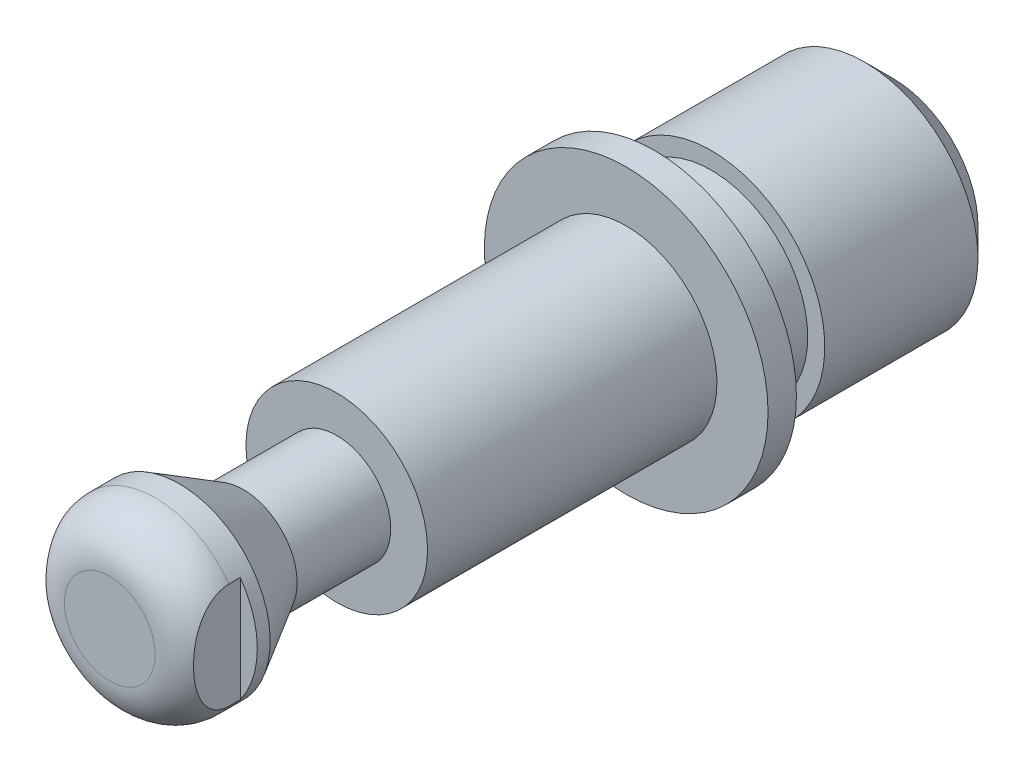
ISO-10303-21;
HEADER;
FILE_DESCRIPTION(('STEP AP214'),'2;1');
FILE_NAME('part.step','',(''),(''),'','','');
FILE_SCHEMA(('AUTOMOTIVE_DESIGN { 1 0 10303 214 1 1 1 1 }'));
ENDSEC;
DATA;
#1=APPLICATION_CONTEXT('core data for automotive mechanical design processes');
#2=APPLICATION_PROTOCOL_DEFINITION('international standard','automotive_design',2000,#1);
#3=PRODUCT_CONTEXT('',#1,'mechanical');
#4=PRODUCT('Part','Part','',(#3));
#5=PRODUCT_RELATED_PRODUCT_CATEGORY('part','',(#4));
#6=PRODUCT_DEFINITION_FORMATION('','',#4);
#7=PRODUCT_DEFINITION_CONTEXT('part definition',#1,'design');
#8=PRODUCT_DEFINITION('design','',#6,#7);
#9=PRODUCT_DEFINITION_SHAPE('','',#8);
#10=(LENGTH_UNIT() NAMED_UNIT(*) SI_UNIT(.MILLI.,.METRE.));
#11=(NAMED_UNIT(*) PLANE_ANGLE_UNIT() SI_UNIT($,.RADIAN.));
#12=(NAMED_UNIT(*) SI_UNIT($,.STERADIAN.) SOLID_ANGLE_UNIT());
#13=UNCERTAINTY_MEASURE_WITH_UNIT(LENGTH_MEASURE(1.E-05),#10,'distance_accuracy_value','');
#14=(GEOMETRIC_REPRESENTATION_CONTEXT(3) GLOBAL_UNCERTAINTY_ASSIGNED_CONTEXT((#13)) GLOBAL_UNIT_ASSIGNED_CONTEXT((#10,
#11,#12)) REPRESENTATION_CONTEXT('',''));
#15=CARTESIAN_POINT('',(0.,0.,0.));
#16=DIRECTION('',(0.,0.,1.));
#17=DIRECTION('',(1.,0.,0.));
#18=AXIS2_PLACEMENT_3D('',#15,#16,#17);
#19=CARTESIAN_POINT('',(0.,0.,0.));
#20=DIRECTION('',(0.,0.,-1.));
#21=DIRECTION('',(0.,1.,0.));
#22=AXIS2_PLACEMENT_3D('',#19,#20,#21);
#23=PLANE('',#22);
#24=CARTESIAN_POINT('',(0.,0.,0.));
#25=DIRECTION('',(0.,0.,1.));
#26=DIRECTION('',(0.,-1.,0.));
#27=AXIS2_PLACEMENT_3D('',#24,#25,#26);
#28=CIRCLE('',#27,12.5);
#29=CARTESIAN_POINT('',(0.,-12.5,0.));
#30=VERTEX_POINT('',#29);
#31=EDGE_CURVE('E89',#30,#30,#28,.T.);
#32=ORIENTED_EDGE('',*,*,#31,.F.);
#33=EDGE_LOOP('',(#32));
#34=FACE_BOUND('',#33,.T.);
#35=CARTESIAN_POINT('',(0.,0.,0.));
#36=DIRECTION('',(0.,0.,-1.));
#37=DIRECTION('',(1.,0.,0.));
#38=AXIS2_PLACEMENT_3D('',#35,#36,#37);
#39=CIRCLE('',#38,8.5);
#40=CARTESIAN_POINT('',(8.5,0.,0.));
#41=VERTEX_POINT('',#40);
#42=EDGE_CURVE('E85',#41,#41,#39,.T.);
#43=ORIENTED_EDGE('',*,*,#42,.F.);
#44=EDGE_LOOP('',(#43));
#45=FACE_BOUND('',#44,.T.);
#46=ADVANCED_FACE('F14',(#34,#45),#23,.T.);
#47=CARTESIAN_POINT('',(0.,0.,48.));
#48=DIRECTION('',(0.,0.,1.));
#49=DIRECTION('',(0.,-1.,0.));
#50=AXIS2_PLACEMENT_3D('',#47,#48,#49);
#51=PLANE('',#50);
#52=CARTESIAN_POINT('',(0.,0.,48.));
#53=DIRECTION('',(0.,0.,1.));
#54=DIRECTION('',(0.,-1.,0.));
#55=AXIS2_PLACEMENT_3D('',#52,#53,#54);
#56=CIRCLE('',#55,4.);
#57=CARTESIAN_POINT('',(0.,-4.,48.));
#58=VERTEX_POINT('',#57);
#59=EDGE_CURVE('E110',#58,#58,#56,.T.);
#60=ORIENTED_EDGE('',*,*,#59,.T.);
#61=EDGE_LOOP('',(#60));
#62=FACE_BOUND('',#61,.T.);
#63=ADVANCED_FACE('F157',(#62),#51,.T.);
#64=CARTESIAN_POINT('',(0.,0.,0.));
#65=DIRECTION('',(0.,0.,1.));
#66=DIRECTION('',(0.,-1.,0.));
#67=AXIS2_PLACEMENT_3D('',#64,#65,#66);
#68=CYLINDRICAL_SURFACE('',#67,8.);
#69=DIRECTION('',(0.,0.,1.));
#70=VECTOR('',#69,1.);
#71=CARTESIAN_POINT('',(6.5,-4.66368952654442,0.));
#72=LINE('',#71,#70);
#73=CARTESIAN_POINT('',(6.5,-4.66368952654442,44.));
#74=VERTEX_POINT('',#73);
#75=CARTESIAN_POINT('',(6.5,-4.66368952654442,43.));
#76=VERTEX_POINT('',#75);
#77=EDGE_CURVE('E64',#74,#76,#72,.F.);
#78=ORIENTED_EDGE('',*,*,#77,.F.);
#79=CARTESIAN_POINT('',(0.,0.,44.));
#80=DIRECTION('',(0.,0.,1.));
#81=DIRECTION('',(0.,-1.,0.));
#82=AXIS2_PLACEMENT_3D('',#79,#80,#81);
#83=CIRCLE('',#82,8.);
#84=CARTESIAN_POINT('',(-6.5,-4.66368952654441,44.));
#85=VERTEX_POINT('',#84);
#86=EDGE_CURVE('E37',#74,#85,#83,.F.);
#87=ORIENTED_EDGE('',*,*,#86,.T.);
#88=DIRECTION('',(0.,0.,1.));
#89=VECTOR('',#88,1.);
#90=CARTESIAN_POINT('',(-6.5,-4.66368952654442,0.));
#91=LINE('',#90,#89);
#92=CARTESIAN_POINT('',(-6.5,-4.66368952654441,43.));
#93=VERTEX_POINT('',#92);
#94=EDGE_CURVE('E78',#93,#85,#91,.T.);
#95=ORIENTED_EDGE('',*,*,#94,.F.);
#96=CARTESIAN_POINT('',(0.,0.,43.));
#97=DIRECTION('',(0.,0.,-1.));
#98=DIRECTION('',(1.,0.,0.));
#99=AXIS2_PLACEMENT_3D('',#96,#97,#98);
#100=CIRCLE('',#99,8.);
#101=CARTESIAN_POINT('',(-6.5,4.66368952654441,43.));
#102=VERTEX_POINT('',#101);
#103=EDGE_CURVE('E123',#102,#93,#100,.F.);
#104=ORIENTED_EDGE('',*,*,#103,.F.);
#105=DIRECTION('',(0.,0.,1.));
#106=VECTOR('',#105,1.);
#107=CARTESIAN_POINT('',(-6.5,4.66368952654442,0.));
#108=LINE('',#107,#106);
#109=CARTESIAN_POINT('',(-6.5,4.66368952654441,44.));
#110=VERTEX_POINT('',#109);
#111=EDGE_CURVE('E80',#110,#102,#108,.F.);
#112=ORIENTED_EDGE('',*,*,#111,.F.);
#113=CARTESIAN_POINT('',(6.5,4.66368952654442,44.));
#114=VERTEX_POINT('',#113);
#115=EDGE_CURVE('E71',#110,#114,#83,.F.);
#116=ORIENTED_EDGE('',*,*,#115,.T.);
#117=DIRECTION('',(0.,0.,1.));
#118=VECTOR('',#117,1.);
#119=CARTESIAN_POINT('',(6.5,4.66368952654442,0.));
#120=LINE('',#119,#118);
#121=CARTESIAN_POINT('',(6.5,4.66368952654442,43.));
#122=VERTEX_POINT('',#121);
#123=EDGE_CURVE('E29',#122,#114,#120,.T.);
#124=ORIENTED_EDGE('',*,*,#123,.F.);
#125=CARTESIAN_POINT('',(0.,0.,43.));
#126=DIRECTION('',(0.,0.,-1.));
#127=DIRECTION('',(1.,0.,0.));
#128=AXIS2_PLACEMENT_3D('',#125,#126,#127);
#129=CIRCLE('',#128,8.);
#130=EDGE_CURVE('E58',#76,#122,#129,.F.);
#131=ORIENTED_EDGE('',*,*,#130,.F.);
#132=EDGE_LOOP('',(#78,#87,#95,#104,#112,#116,#124,#131));
#133=FACE_BOUND('',#132,.T.);
#134=CARTESIAN_POINT('',(0.,0.,41.8691651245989));
#135=DIRECTION('',(0.,0.,1.));
#136=DIRECTION('',(0.,-1.,0.));
#137=AXIS2_PLACEMENT_3D('',#134,#135,#136);
#138=CIRCLE('',#137,8.);
#139=CARTESIAN_POINT('',(0.,-8.,41.8691651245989));
#140=VERTEX_POINT('',#139);
#141=EDGE_CURVE('E107',#140,#140,#138,.T.);
#142=ORIENTED_EDGE('',*,*,#141,.T.);
#143=EDGE_LOOP('',(#142));
#144=FACE_BOUND('',#143,.T.);
#145=ADVANCED_FACE('F67',(#133,#144),#68,.T.);
#146=CARTESIAN_POINT('',(0.,0.,41.8691651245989));
#147=DIRECTION('',(0.,0.,1.));
#148=DIRECTION('',(0.,-1.,0.));
#149=AXIS2_PLACEMENT_3D('',#146,#147,#148);
#150=CONICAL_SURFACE('',#149,8.,0.5235987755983);
#151=CARTESIAN_POINT('',(0.,0.,36.24));
#152=DIRECTION('',(0.,0.,1.));
#153=DIRECTION('',(0.,-1.,0.));
#154=AXIS2_PLACEMENT_3D('',#151,#152,#153);
#155=CIRCLE('',#154,4.75);
#156=CARTESIAN_POINT('',(0.,-4.75,36.24));
#157=VERTEX_POINT('',#156);
#158=EDGE_CURVE('E104',#157,#157,#155,.T.);
#159=ORIENTED_EDGE('',*,*,#158,.T.);
#160=EDGE_LOOP('',(#159));
#161=FACE_BOUND('',#160,.T.);
#162=ORIENTED_EDGE('',*,*,#141,.F.);
#163=EDGE_LOOP('',(#162));
#164=FACE_BOUND('',#163,.T.);
#165=ADVANCED_FACE('F186',(#161,#164),#150,.T.);
#166=CARTESIAN_POINT('',(0.,0.,0.));
#167=DIRECTION('',(0.,0.,1.));
#168=DIRECTION('',(0.,-1.,0.));
#169=AXIS2_PLACEMENT_3D('',#166,#167,#168);
#170=CYLINDRICAL_SURFACE('',#169,4.75);
#171=CARTESIAN_POINT('',(0.,0.,28.));
#172=DIRECTION('',(0.,0.,1.));
#173=DIRECTION('',(0.,-1.,0.));
#174=AXIS2_PLACEMENT_3D('',#171,#172,#173);
#175=CIRCLE('',#174,4.75);
#176=CARTESIAN_POINT('',(0.,-4.75,28.));
#177=VERTEX_POINT('',#176);
#178=EDGE_CURVE('E101',#177,#177,#175,.T.);
#179=ORIENTED_EDGE('',*,*,#178,.T.);
#180=EDGE_LOOP('',(#179));
#181=FACE_BOUND('',#180,.T.);
#182=ORIENTED_EDGE('',*,*,#158,.F.);
#183=EDGE_LOOP('',(#182));
#184=FACE_BOUND('',#183,.T.);
#185=ADVANCED_FACE('F182',(#181,#184),#170,.T.);
#186=CARTESIAN_POINT('',(0.,-4.75,28.));
#187=DIRECTION('',(0.,0.,1.));
#188=DIRECTION('',(0.,-1.,0.));
#189=AXIS2_PLACEMENT_3D('',#186,#187,#188);
#190=PLANE('',#189);
#191=CARTESIAN_POINT('',(0.,0.,28.));
#192=DIRECTION('',(0.,0.,1.));
#193=DIRECTION('',(0.,-1.,0.));
#194=AXIS2_PLACEMENT_3D('',#191,#192,#193);
#195=CIRCLE('',#194,8.);
#196=CARTESIAN_POINT('',(0.,-8.,28.));
#197=VERTEX_POINT('',#196);
#198=EDGE_CURVE('E98',#197,#197,#195,.T.);
#199=ORIENTED_EDGE('',*,*,#198,.T.);
#200=EDGE_LOOP('',(#199));
#201=FACE_BOUND('',#200,.T.);
#202=ORIENTED_EDGE('',*,*,#178,.F.);
#203=EDGE_LOOP('',(#202));
#204=FACE_BOUND('',#203,.T.);
#205=ADVANCED_FACE('F178',(#201,#204),#190,.T.);
#206=CARTESIAN_POINT('',(0.,0.,0.));
#207=DIRECTION('',(0.,0.,1.));
#208=DIRECTION('',(0.,-1.,0.));
#209=AXIS2_PLACEMENT_3D('',#206,#207,#208);
#210=CYLINDRICAL_SURFACE('',#209,8.);
#211=CARTESIAN_POINT('',(0.,0.,2.5));
#212=DIRECTION('',(0.,0.,1.));
#213=DIRECTION('',(0.,-1.,0.));
#214=AXIS2_PLACEMENT_3D('',#211,#212,#213);
#215=CIRCLE('',#214,8.);
#216=CARTESIAN_POINT('',(0.,-8.,2.5));
#217=VERTEX_POINT('',#216);
#218=EDGE_CURVE('E95',#217,#217,#215,.T.);
#219=ORIENTED_EDGE('',*,*,#218,.T.);
#220=EDGE_LOOP('',(#219));
#221=FACE_BOUND('',#220,.T.);
#222=ORIENTED_EDGE('',*,*,#198,.F.);
#223=EDGE_LOOP('',(#222));
#224=FACE_BOUND('',#223,.T.);
#225=ADVANCED_FACE('F174',(#221,#224),#210,.T.);
#226=CARTESIAN_POINT('',(0.,-12.5,2.5));
#227=DIRECTION('',(0.,0.,1.));
#228=DIRECTION('',(0.,-1.,0.));
#229=AXIS2_PLACEMENT_3D('',#226,#227,#228);
#230=PLANE('',#229);
#231=CARTESIAN_POINT('',(0.,0.,2.5));
#232=DIRECTION('',(0.,0.,1.));
#233=DIRECTION('',(0.,-1.,0.));
#234=AXIS2_PLACEMENT_3D('',#231,#232,#233);
#235=CIRCLE('',#234,12.5);
#236=CARTESIAN_POINT('',(0.,-12.5,2.5));
#237=VERTEX_POINT('',#236);
#238=EDGE_CURVE('E92',#237,#237,#235,.T.);
#239=ORIENTED_EDGE('',*,*,#238,.T.);
#240=EDGE_LOOP('',(#239));
#241=FACE_BOUND('',#240,.T.);
#242=ORIENTED_EDGE('',*,*,#218,.F.);
#243=EDGE_LOOP('',(#242));
#244=FACE_BOUND('',#243,.T.);
#245=ADVANCED_FACE('F170',(#241,#244),#230,.T.);
#246=CARTESIAN_POINT('',(0.,0.,0.));
#247=DIRECTION('',(0.,0.,1.));
#248=DIRECTION('',(0.,-1.,0.));
#249=AXIS2_PLACEMENT_3D('',#246,#247,#248);
#250=CYLINDRICAL_SURFACE('',#249,12.5);
#251=ORIENTED_EDGE('',*,*,#31,.T.);
#252=EDGE_LOOP('',(#251));
#253=FACE_BOUND('',#252,.T.);
#254=ORIENTED_EDGE('',*,*,#238,.F.);
#255=EDGE_LOOP('',(#254));
#256=FACE_BOUND('',#255,.T.);
#257=ADVANCED_FACE('F167',(#253,#256),#250,.T.);
#258=CARTESIAN_POINT('',(0.,0.,44.));
#259=DIRECTION('',(0.,0.,1.));
#260=DIRECTION('',(0.,-1.,0.));
#261=AXIS2_PLACEMENT_3D('',#258,#259,#260);
#262=DEGENERATE_TOROIDAL_SURFACE('',#261,4.,4.,.T.);
#263=CARTESIAN_POINT('',(6.5,0.,47.1224989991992));
#264=CARTESIAN_POINT('',(6.5,-0.206844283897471,47.1225044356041));
#265=CARTESIAN_POINT('',(6.5,-0.413723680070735,47.1146377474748));
#266=CARTESIAN_POINT('',(6.5,-0.82639294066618,47.0826488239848));
#267=CARTESIAN_POINT('',(6.5,-1.03218184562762,47.0585141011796));
#268=CARTESIAN_POINT('',(6.5,-1.44076522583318,46.9924737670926));
#269=CARTESIAN_POINT('',(6.5,-1.64356226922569,46.9505844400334));
#270=CARTESIAN_POINT('',(6.5,-2.04379599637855,46.8467158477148));
#271=CARTESIAN_POINT('',(6.5,-2.24123900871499,46.7847615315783));
#272=CARTESIAN_POINT('',(6.5,-2.6257340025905,46.6384856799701));
#273=CARTESIAN_POINT('',(6.5,-2.81286529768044,46.5543766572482));
#274=CARTESIAN_POINT('',(6.5,-3.17339855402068,46.3606787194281));
#275=CARTESIAN_POINT('',(6.5,-3.34682225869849,46.2511312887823));
#276=CARTESIAN_POINT('',(6.5,-3.64791360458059,46.0234028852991));
#277=CARTESIAN_POINT('',(6.5,-3.77851688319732,45.9091377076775));
#278=CARTESIAN_POINT('',(6.5,-4.01931634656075,45.6606747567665));
#279=CARTESIAN_POINT('',(6.5,-4.12953184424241,45.5264960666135));
#280=CARTESIAN_POINT('',(6.5,-4.30622665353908,45.2651657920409));
#281=CARTESIAN_POINT('',(6.5,-4.37698745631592,45.1409173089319));
#282=CARTESIAN_POINT('',(6.5,-4.49686600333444,44.8823333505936));
#283=CARTESIAN_POINT('',(6.5,-4.5459944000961,44.7480028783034));
#284=CARTESIAN_POINT('',(6.5,-4.61991783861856,44.4720985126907));
#285=CARTESIAN_POINT('',(6.5,-4.64460389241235,44.3304951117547));
#286=CARTESIAN_POINT('',(6.5,-4.66762977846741,44.0451551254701));
#287=CARTESIAN_POINT('',(6.5,-4.66597507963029,43.9014189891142));
#288=CARTESIAN_POINT('',(6.5,-4.63759258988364,43.6275896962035));
#289=CARTESIAN_POINT('',(6.5,-4.61278528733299,43.497291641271));
#290=CARTESIAN_POINT('',(6.5,-4.54221558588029,43.2425527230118));
#291=CARTESIAN_POINT('',(6.5,-4.49645377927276,43.1181116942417));
#292=CARTESIAN_POINT('',(6.5,-4.38471293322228,42.8744777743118));
#293=CARTESIAN_POINT('',(6.5,-4.3182015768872,42.7555308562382));
#294=CARTESIAN_POINT('',(6.5,-4.16847613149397,42.5287171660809));
#295=CARTESIAN_POINT('',(6.5,-4.08525303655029,42.4208564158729));
#296=CARTESIAN_POINT('',(6.5,-3.86724260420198,42.1743794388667));
#297=CARTESIAN_POINT('',(6.5,-3.72548986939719,42.0419084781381));
#298=CARTESIAN_POINT('',(6.5,-3.42247196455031,41.8017298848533));
#299=CARTESIAN_POINT('',(6.5,-3.26117323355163,41.694065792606));
#300=CARTESIAN_POINT('',(6.5,-2.85157841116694,41.4597006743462));
#301=CARTESIAN_POINT('',(6.5,-2.59618561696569,41.3454046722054));
#302=CARTESIAN_POINT('',(6.5,-2.20250582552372,41.2046974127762));
#303=CARTESIAN_POINT('',(6.5,-2.06925974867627,41.1628694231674));
#304=CARTESIAN_POINT('',(6.5,-1.80017257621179,41.0885796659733));
#305=CARTESIAN_POINT('',(6.5,-1.66433200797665,41.0561160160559));
#306=CARTESIAN_POINT('',(6.5,-1.31769188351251,40.9846693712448));
#307=CARTESIAN_POINT('',(6.5,-1.10569583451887,40.9515006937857));
#308=CARTESIAN_POINT('',(6.5,-0.679590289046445,40.9031779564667));
#309=CARTESIAN_POINT('',(6.5,-0.46547946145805,40.8880360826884));
#310=CARTESIAN_POINT('',(6.5,-0.0366429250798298,40.8747393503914));
#311=CARTESIAN_POINT('',(6.5,0.178083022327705,40.8765923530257));
#312=CARTESIAN_POINT('',(6.5,0.606616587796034,40.8974276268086));
#313=CARTESIAN_POINT('',(6.5,0.820424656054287,40.916400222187));
#314=CARTESIAN_POINT('',(6.5,1.17885367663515,40.9639438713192));
#315=CARTESIAN_POINT('',(6.5,1.32412214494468,40.9876315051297));
#316=CARTESIAN_POINT('',(6.5,1.61280135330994,41.0444174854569));
#317=CARTESIAN_POINT('',(6.5,1.75621171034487,41.0775177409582));
#318=CARTESIAN_POINT('',(6.5,2.18162996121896,41.1921142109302));
#319=CARTESIAN_POINT('',(6.5,2.45990046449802,41.2890344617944));
#320=CARTESIAN_POINT('',(6.5,2.91255534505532,41.495243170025));
#321=CARTESIAN_POINT('',(6.5,3.0927504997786,41.591755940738));
#322=CARTESIAN_POINT('',(6.5,3.43630632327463,41.8114221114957));
#323=CARTESIAN_POINT('',(6.5,3.5996865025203,41.9345441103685));
#324=CARTESIAN_POINT('',(6.5,3.86958100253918,42.1796574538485));
#325=CARTESIAN_POINT('',(6.5,3.98082292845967,42.2964174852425));
#326=CARTESIAN_POINT('',(6.5,4.18285712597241,42.5466212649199));
#327=CARTESIAN_POINT('',(6.5,4.27365703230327,42.680058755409));
#328=CARTESIAN_POINT('',(6.5,4.43031907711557,42.9625461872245));
#329=CARTESIAN_POINT('',(6.5,4.49595824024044,43.1117214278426));
#330=CARTESIAN_POINT('',(6.5,4.59638438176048,43.4201427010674));
#331=CARTESIAN_POINT('',(6.5,4.6311999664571,43.5793792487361));
#332=CARTESIAN_POINT('',(6.5,4.66465778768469,43.8785289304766));
#333=CARTESIAN_POINT('',(6.5,4.66775361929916,44.0179563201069));
#334=CARTESIAN_POINT('',(6.5,4.64910977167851,44.2951083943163));
#335=CARTESIAN_POINT('',(6.5,4.62737796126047,44.4328336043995));
#336=CARTESIAN_POINT('',(6.5,4.56215114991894,44.6954954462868));
#337=CARTESIAN_POINT('',(6.5,4.51982148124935,44.8207261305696));
#338=CARTESIAN_POINT('',(6.5,4.41619392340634,45.0630239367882));
#339=CARTESIAN_POINT('',(6.5,4.35489293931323,45.1800897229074));
#340=CARTESIAN_POINT('',(6.5,4.21068385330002,45.4126534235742));
#341=CARTESIAN_POINT('',(6.5,4.1264793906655,45.5273428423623));
#342=CARTESIAN_POINT('',(6.5,3.94276231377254,45.7436183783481));
#343=CARTESIAN_POINT('',(6.5,3.84324302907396,45.8451987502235));
#344=CARTESIAN_POINT('',(6.5,3.57704737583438,46.084438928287));
#345=CARTESIAN_POINT('',(6.5,3.40242327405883,46.2132706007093));
#346=CARTESIAN_POINT('',(6.5,3.03468146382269,46.4414535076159));
#347=CARTESIAN_POINT('',(6.5,2.84151094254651,46.5407170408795));
#348=CARTESIAN_POINT('',(6.5,2.49271952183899,46.6915848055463));
#349=CARTESIAN_POINT('',(6.5,2.33950097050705,46.7489071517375));
#350=CARTESIAN_POINT('',(6.5,2.02857752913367,46.8499832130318));
#351=CARTESIAN_POINT('',(6.5,1.87086988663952,46.8937283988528));
#352=CARTESIAN_POINT('',(6.5,1.55268949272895,46.9689599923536));
#353=CARTESIAN_POINT('',(6.5,1.39221817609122,47.0004525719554));
#354=CARTESIAN_POINT('',(6.5,1.06957427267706,47.0523335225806));
#355=CARTESIAN_POINT('',(6.5,0.907402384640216,47.0727262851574));
#356=CARTESIAN_POINT('',(6.5,0.62102426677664,47.0995656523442));
#357=CARTESIAN_POINT('',(6.5,0.497014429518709,47.1081812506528));
#358=CARTESIAN_POINT('',(6.5,0.248674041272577,47.1196476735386));
#359=CARTESIAN_POINT('',(6.5,0.12434336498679,47.1224957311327));
#360=CARTESIAN_POINT('',(6.5,0.,47.1224989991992));
#361=B_SPLINE_CURVE_WITH_KNOTS('',3,(#263,#264,#265,#266,#267,#268,#269,#270,#271,#272,#273,
#274,#275,#276,#277,#278,#279,#280,#281,#282,#283,#284,#285,#286,#287,#288,#289,#290,#291,#292,
#293,#294,#295,#296,#297,#298,#299,#300,#301,#302,#303,#304,#305,#306,#307,#308,#309,#310,#311,
#312,#313,#314,#315,#316,#317,#318,#319,#320,#321,#322,#323,#324,#325,#326,#327,#328,#329,#330,
#331,#332,#333,#334,#335,#336,#337,#338,#339,#340,#341,#342,#343,#344,#345,#346,#347,#348,#349,
#350,#351,#352,#353,#354,#355,#356,#357,#358,#359,#360),.UNSPECIFIED.,.T.,.F.,(4,2,2,2,2,2,2,2,
2,2,2,2,2,2,2,2,2,2,2,2,2,2,2,2,2,2,2,2,2,2,2,2,2,2,2,2,2,2,2,2,2,2,2,2,2,2,2,2,4),(0.,
0.620437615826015,1.24135202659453,1.86169817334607,2.48127591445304,3.09511426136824,
3.70795851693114,4.22659549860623,4.74473864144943,5.17190085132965,5.59885247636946,
6.02769941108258,6.456457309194,6.85253859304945,7.2486086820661,7.65581612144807,
8.06324359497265,8.6420349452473,9.22183456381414,10.0562668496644,10.4750231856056,
10.8936952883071,11.5365091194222,12.1797572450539,12.8233029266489,13.466485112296,
13.9077415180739,14.3490874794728,15.2285544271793,15.8399392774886,16.4506065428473,
16.9325628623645,17.4143388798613,17.9002907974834,18.3857912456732,18.8019993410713,
19.2180755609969,19.6129512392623,20.0078913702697,20.4331144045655,20.8585231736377,
21.5058893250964,22.1551569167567,22.6452750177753,23.1357003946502,23.6258784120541,
24.1158623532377,24.4886563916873,24.8616292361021),.UNSPECIFIED.);
#362=EDGE_CURVE('E61',#114,#74,#361,.T.);
#363=ORIENTED_EDGE('',*,*,#362,.F.);
#364=ORIENTED_EDGE('',*,*,#115,.F.);
#365=CARTESIAN_POINT('',(-6.5,0.,47.1224989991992));
#366=CARTESIAN_POINT('',(-6.5,0.20684428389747,47.1225044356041));
#367=CARTESIAN_POINT('',(-6.5,0.413723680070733,47.1146377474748));
#368=CARTESIAN_POINT('',(-6.5,0.826392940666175,47.0826488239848));
#369=CARTESIAN_POINT('',(-6.5,1.03218184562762,47.0585141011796));
#370=CARTESIAN_POINT('',(-6.5,1.44076522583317,46.9924737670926));
#371=CARTESIAN_POINT('',(-6.5,1.64356226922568,46.9505844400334));
#372=CARTESIAN_POINT('',(-6.5,2.04379599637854,46.8467158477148));
#373=CARTESIAN_POINT('',(-6.5,2.24123900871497,46.7847615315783));
#374=CARTESIAN_POINT('',(-6.5,2.62573400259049,46.6384856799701));
#375=CARTESIAN_POINT('',(-6.5,2.81286529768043,46.5543766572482));
#376=CARTESIAN_POINT('',(-6.5,3.17339855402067,46.3606787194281));
#377=CARTESIAN_POINT('',(-6.5,3.34682225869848,46.2511312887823));
#378=CARTESIAN_POINT('',(-6.5,3.64791360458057,46.0234028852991));
#379=CARTESIAN_POINT('',(-6.5,3.77851688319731,45.9091377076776));
#380=CARTESIAN_POINT('',(-6.5,4.01931634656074,45.6606747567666));
#381=CARTESIAN_POINT('',(-6.5,4.1295318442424,45.5264960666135));
#382=CARTESIAN_POINT('',(-6.5,4.30622665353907,45.2651657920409));
#383=CARTESIAN_POINT('',(-6.5,4.37698745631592,45.1409173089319));
#384=CARTESIAN_POINT('',(-6.5,4.49686600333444,44.8823333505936));
#385=CARTESIAN_POINT('',(-6.5,4.54599440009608,44.7480028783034));
#386=CARTESIAN_POINT('',(-6.5,4.61991783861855,44.4720985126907));
#387=CARTESIAN_POINT('',(-6.5,4.64460389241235,44.3304951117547));
#388=CARTESIAN_POINT('',(-6.5,4.66762977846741,44.0451551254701));
#389=CARTESIAN_POINT('',(-6.5,4.66597507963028,43.9014189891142));
#390=CARTESIAN_POINT('',(-6.5,4.63759258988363,43.6275896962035));
#391=CARTESIAN_POINT('',(-6.5,4.61278528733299,43.497291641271));
#392=CARTESIAN_POINT('',(-6.5,4.54221558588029,43.2425527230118));
#393=CARTESIAN_POINT('',(-6.5,4.49645377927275,43.1181116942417));
#394=CARTESIAN_POINT('',(-6.5,4.38471293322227,42.8744777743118));
#395=CARTESIAN_POINT('',(-6.5,4.31820157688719,42.7555308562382));
#396=CARTESIAN_POINT('',(-6.5,4.16847613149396,42.5287171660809));
#397=CARTESIAN_POINT('',(-6.5,4.08525303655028,42.4208564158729));
#398=CARTESIAN_POINT('',(-6.5,3.86724260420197,42.1743794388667));
#399=CARTESIAN_POINT('',(-6.5,3.72548986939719,42.0419084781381));
#400=CARTESIAN_POINT('',(-6.5,3.4224719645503,41.8017298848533));
#401=CARTESIAN_POINT('',(-6.5,3.26117323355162,41.694065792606));
#402=CARTESIAN_POINT('',(-6.5,2.85157841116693,41.4597006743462));
#403=CARTESIAN_POINT('',(-6.5,2.59618561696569,41.3454046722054));
#404=CARTESIAN_POINT('',(-6.5,2.20250582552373,41.2046974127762));
#405=CARTESIAN_POINT('',(-6.5,2.06925974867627,41.1628694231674));
#406=CARTESIAN_POINT('',(-6.5,1.80017257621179,41.0885796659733));
#407=CARTESIAN_POINT('',(-6.5,1.66433200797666,41.0561160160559));
#408=CARTESIAN_POINT('',(-6.5,1.31769188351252,40.9846693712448));
#409=CARTESIAN_POINT('',(-6.5,1.10569583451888,40.9515006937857));
#410=CARTESIAN_POINT('',(-6.5,0.679590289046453,40.9031779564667));
#411=CARTESIAN_POINT('',(-6.5,0.465479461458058,40.8880360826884));
#412=CARTESIAN_POINT('',(-6.5,0.0366429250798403,40.8747393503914));
#413=CARTESIAN_POINT('',(-6.5,-0.178083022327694,40.8765923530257));
#414=CARTESIAN_POINT('',(-6.5,-0.606616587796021,40.8974276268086));
#415=CARTESIAN_POINT('',(-6.5,-0.820424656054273,40.916400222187));
#416=CARTESIAN_POINT('',(-6.5,-1.17885367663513,40.9639438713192));
#417=CARTESIAN_POINT('',(-6.5,-1.32412214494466,40.9876315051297));
#418=CARTESIAN_POINT('',(-6.5,-1.61280135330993,41.0444174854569));
#419=CARTESIAN_POINT('',(-6.5,-1.75621171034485,41.0775177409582));
#420=CARTESIAN_POINT('',(-6.5,-2.18162996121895,41.1921142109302));
#421=CARTESIAN_POINT('',(-6.5,-2.459900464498,41.2890344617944));
#422=CARTESIAN_POINT('',(-6.5,-2.91255534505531,41.4952431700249));
#423=CARTESIAN_POINT('',(-6.5,-3.09275049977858,41.5917559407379));
#424=CARTESIAN_POINT('',(-6.5,-3.43630632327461,41.8114221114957));
#425=CARTESIAN_POINT('',(-6.5,-3.59968650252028,41.9345441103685));
#426=CARTESIAN_POINT('',(-6.5,-3.86958100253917,42.1796574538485));
#427=CARTESIAN_POINT('',(-6.5,-3.98082292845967,42.2964174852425));
#428=CARTESIAN_POINT('',(-6.5,-4.18285712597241,42.5466212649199));
#429=CARTESIAN_POINT('',(-6.5,-4.27365703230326,42.680058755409));
#430=CARTESIAN_POINT('',(-6.5,-4.43031907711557,42.9625461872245));
#431=CARTESIAN_POINT('',(-6.5,-4.49595824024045,43.1117214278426));
#432=CARTESIAN_POINT('',(-6.5,-4.59638438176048,43.4201427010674));
#433=CARTESIAN_POINT('',(-6.5,-4.63119996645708,43.5793792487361));
#434=CARTESIAN_POINT('',(-6.5,-4.66465778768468,43.8785289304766));
#435=CARTESIAN_POINT('',(-6.5,-4.66775361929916,44.0179563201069));
#436=CARTESIAN_POINT('',(-6.5,-4.64910977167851,44.2951083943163));
#437=CARTESIAN_POINT('',(-6.5,-4.62737796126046,44.4328336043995));
#438=CARTESIAN_POINT('',(-6.5,-4.56215114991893,44.6954954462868));
#439=CARTESIAN_POINT('',(-6.5,-4.51982148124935,44.8207261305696));
#440=CARTESIAN_POINT('',(-6.5,-4.41619392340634,45.0630239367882));
#441=CARTESIAN_POINT('',(-6.5,-4.35489293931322,45.1800897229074));
#442=CARTESIAN_POINT('',(-6.5,-4.2106838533,45.4126534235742));
#443=CARTESIAN_POINT('',(-6.5,-4.12647939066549,45.5273428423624));
#444=CARTESIAN_POINT('',(-6.5,-3.94276231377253,45.7436183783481));
#445=CARTESIAN_POINT('',(-6.5,-3.84324302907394,45.8451987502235));
#446=CARTESIAN_POINT('',(-6.5,-3.57704737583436,46.084438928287));
#447=CARTESIAN_POINT('',(-6.5,-3.40242327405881,46.2132706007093));
#448=CARTESIAN_POINT('',(-6.5,-3.03468146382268,46.4414535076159));
#449=CARTESIAN_POINT('',(-6.5,-2.8415109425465,46.5407170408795));
#450=CARTESIAN_POINT('',(-6.5,-2.49271952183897,46.6915848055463));
#451=CARTESIAN_POINT('',(-6.5,-2.33950097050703,46.7489071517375));
#452=CARTESIAN_POINT('',(-6.5,-2.02857752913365,46.8499832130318));
#453=CARTESIAN_POINT('',(-6.5,-1.8708698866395,46.8937283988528));
#454=CARTESIAN_POINT('',(-6.5,-1.55268949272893,46.9689599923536));
#455=CARTESIAN_POINT('',(-6.5,-1.3922181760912,47.0004525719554));
#456=CARTESIAN_POINT('',(-6.5,-1.06957427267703,47.0523335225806));
#457=CARTESIAN_POINT('',(-6.5,-0.907402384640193,47.0727262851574));
#458=CARTESIAN_POINT('',(-6.5,-0.621024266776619,47.0995656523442));
#459=CARTESIAN_POINT('',(-6.5,-0.497014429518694,47.1081812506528));
#460=CARTESIAN_POINT('',(-6.5,-0.24867404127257,47.1196476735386));
#461=CARTESIAN_POINT('',(-6.5,-0.124343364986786,47.1224957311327));
#462=CARTESIAN_POINT('',(-6.5,0.,47.1224989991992));
#463=B_SPLINE_CURVE_WITH_KNOTS('',3,(#365,#366,#367,#368,#369,#370,#371,#372,#373,#374,#375,
#376,#377,#378,#379,#380,#381,#382,#383,#384,#385,#386,#387,#388,#389,#390,#391,#392,#393,#394,
#395,#396,#397,#398,#399,#400,#401,#402,#403,#404,#405,#406,#407,#408,#409,#410,#411,#412,#413,
#414,#415,#416,#417,#418,#419,#420,#421,#422,#423,#424,#425,#426,#427,#428,#429,#430,#431,#432,
#433,#434,#435,#436,#437,#438,#439,#440,#441,#442,#443,#444,#445,#446,#447,#448,#449,#450,#451,
#452,#453,#454,#455,#456,#457,#458,#459,#460,#461,#462),.UNSPECIFIED.,.T.,.F.,(4,2,2,2,2,2,2,2,
2,2,2,2,2,2,2,2,2,2,2,2,2,2,2,2,2,2,2,2,2,2,2,2,2,2,2,2,2,2,2,2,2,2,2,2,2,2,2,2,4),(0.,
0.620437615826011,1.24135202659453,1.86169817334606,2.48127591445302,3.09511426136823,
3.70795851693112,4.22659549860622,4.74473864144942,5.17190085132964,5.59885247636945,
6.02769941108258,6.456457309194,6.85253859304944,7.2486086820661,7.65581612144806,
8.06324359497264,8.64203494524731,9.22183456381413,10.0562668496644,10.4750231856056,
10.8936952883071,11.5365091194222,12.1797572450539,12.8233029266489,13.466485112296,
13.9077415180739,14.3490874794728,15.2285544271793,15.8399392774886,16.4506065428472,
16.9325628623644,17.4143388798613,17.9002907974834,18.3857912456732,18.8019993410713,
19.2180755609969,19.6129512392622,20.0078913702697,20.4331144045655,20.8585231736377,
21.5058893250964,22.1551569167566,22.6452750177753,23.1357003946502,23.625878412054,
24.1158623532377,24.4886563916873,24.8616292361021),.UNSPECIFIED.);
#464=EDGE_CURVE('E114',#85,#110,#463,.T.);
#465=ORIENTED_EDGE('',*,*,#464,.F.);
#466=ORIENTED_EDGE('',*,*,#86,.F.);
#467=EDGE_LOOP('',(#363,#364,#465,#466));
#468=FACE_BOUND('',#467,.T.);
#469=ORIENTED_EDGE('',*,*,#59,.F.);
#470=EDGE_LOOP('',(#469));
#471=FACE_BOUND('',#470,.T.);
#472=ADVANCED_FACE('F125',(#468,#471),#262,.T.);
#473=CARTESIAN_POINT('',(0.,-8.5,-5.));
#474=DIRECTION('',(0.,0.,1.));
#475=DIRECTION('',(-1.,0.,0.));
#476=AXIS2_PLACEMENT_3D('',#473,#474,#475);
#477=PLANE('',#476);
#478=CARTESIAN_POINT('',(0.,0.,-5.));
#479=DIRECTION('',(0.,0.,-1.));
#480=DIRECTION('',(1.,0.,0.));
#481=AXIS2_PLACEMENT_3D('',#478,#479,#480);
#482=CIRCLE('',#481,8.5);
#483=CARTESIAN_POINT('',(8.5,0.,-5.));
#484=VERTEX_POINT('',#483);
#485=EDGE_CURVE('E82',#484,#484,#482,.T.);
#486=ORIENTED_EDGE('',*,*,#485,.T.);
#487=EDGE_LOOP('',(#486));
#488=FACE_BOUND('',#487,.T.);
#489=CARTESIAN_POINT('',(0.,0.,-5.));
#490=DIRECTION('',(0.,0.,1.));
#491=DIRECTION('',(-1.,0.,0.));
#492=AXIS2_PLACEMENT_3D('',#489,#490,#491);
#493=CIRCLE('',#492,10.);
#494=CARTESIAN_POINT('',(-10.,0.,-5.));
#495=VERTEX_POINT('',#494);
#496=EDGE_CURVE('E88',#495,#495,#493,.T.);
#497=ORIENTED_EDGE('',*,*,#496,.T.);
#498=EDGE_LOOP('',(#497));
#499=FACE_BOUND('',#498,.T.);
#500=ADVANCED_FACE('F138',(#488,#499),#477,.T.);
#501=CARTESIAN_POINT('',(0.,0.,-4.66905042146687));
#502=DIRECTION('',(0.,0.,-1.));
#503=DIRECTION('',(1.,0.,0.));
#504=AXIS2_PLACEMENT_3D('',#501,#502,#503);
#505=CYLINDRICAL_SURFACE('',#504,8.5);
#506=ORIENTED_EDGE('',*,*,#42,.T.);
#507=EDGE_LOOP('',(#506));
#508=FACE_BOUND('',#507,.T.);
#509=ORIENTED_EDGE('',*,*,#485,.F.);
#510=EDGE_LOOP('',(#509));
#511=FACE_BOUND('',#510,.T.);
#512=ADVANCED_FACE('F141',(#508,#511),#505,.T.);
#513=CARTESIAN_POINT('',(0.,0.,-21.));
#514=DIRECTION('',(0.,0.,-1.));
#515=DIRECTION('',(0.,1.,0.));
#516=AXIS2_PLACEMENT_3D('',#513,#514,#515);
#517=PLANE('',#516);
#518=CARTESIAN_POINT('',(0.,0.,-21.));
#519=DIRECTION('',(0.,0.,-1.));
#520=DIRECTION('',(0.,1.,0.));
#521=AXIS2_PLACEMENT_3D('',#518,#519,#520);
#522=CIRCLE('',#521,7.5);
#523=CARTESIAN_POINT('',(0.,7.5,-21.));
#524=VERTEX_POINT('',#523);
#525=EDGE_CURVE('E22',#524,#524,#522,.T.);
#526=ORIENTED_EDGE('',*,*,#525,.T.);
#527=EDGE_LOOP('',(#526));
#528=FACE_BOUND('',#527,.T.);
#529=ADVANCED_FACE('F145',(#528),#517,.T.);
#530=CARTESIAN_POINT('',(0.,0.,-21.));
#531=DIRECTION('',(0.,0.,1.));
#532=DIRECTION('',(0.,-1.,0.));
#533=AXIS2_PLACEMENT_3D('',#530,#531,#532);
#534=CYLINDRICAL_SURFACE('',#533,10.);
#535=CARTESIAN_POINT('',(0.,0.,-18.5));
#536=DIRECTION('',(0.,0.,-1.));
#537=DIRECTION('',(0.,1.,0.));
#538=AXIS2_PLACEMENT_3D('',#535,#536,#537);
#539=CIRCLE('',#538,10.);
#540=CARTESIAN_POINT('',(0.,10.,-18.5));
#541=VERTEX_POINT('',#540);
#542=EDGE_CURVE('E9',#541,#541,#539,.F.);
#543=ORIENTED_EDGE('',*,*,#542,.T.);
#544=EDGE_LOOP('',(#543));
#545=FACE_BOUND('',#544,.T.);
#546=ORIENTED_EDGE('',*,*,#496,.F.);
#547=EDGE_LOOP('',(#546));
#548=FACE_BOUND('',#547,.T.);
#549=ADVANCED_FACE('F135',(#545,#548),#534,.T.);
#550=CARTESIAN_POINT('',(-6.5,21.5,43.));
#551=DIRECTION('',(1.,0.,0.));
#552=DIRECTION('',(0.,0.,1.));
#553=AXIS2_PLACEMENT_3D('',#550,#551,#552);
#554=PLANE('',#553);
#555=ORIENTED_EDGE('',*,*,#111,.T.);
#556=DIRECTION('',(0.,-1.,0.));
#557=VECTOR('',#556,1.);
#558=CARTESIAN_POINT('',(-6.5,21.5,43.));
#559=LINE('',#558,#557);
#560=EDGE_CURVE('E73',#102,#93,#559,.T.);
#561=ORIENTED_EDGE('',*,*,#560,.T.);
#562=ORIENTED_EDGE('',*,*,#94,.T.);
#563=ORIENTED_EDGE('',*,*,#464,.T.);
#564=EDGE_LOOP('',(#555,#561,#562,#563));
#565=FACE_BOUND('',#564,.T.);
#566=ADVANCED_FACE('F129',(#565),#554,.F.);
#567=CARTESIAN_POINT('',(-6.5,21.5,43.));
#568=DIRECTION('',(0.,0.,-1.));
#569=DIRECTION('',(1.,0.,0.));
#570=AXIS2_PLACEMENT_3D('',#567,#568,#569);
#571=PLANE('',#570);
#572=ORIENTED_EDGE('',*,*,#103,.T.);
#573=ORIENTED_EDGE('',*,*,#560,.F.);
#574=EDGE_LOOP('',(#572,#573));
#575=FACE_BOUND('',#574,.T.);
#576=ADVANCED_FACE('F134',(#575),#571,.F.);
#577=CARTESIAN_POINT('',(6.5,21.5,43.));
#578=DIRECTION('',(0.,0.,-1.));
#579=DIRECTION('',(1.,0.,0.));
#580=AXIS2_PLACEMENT_3D('',#577,#578,#579);
#581=PLANE('',#580);
#582=ORIENTED_EDGE('',*,*,#130,.T.);
#583=DIRECTION('',(0.,-1.,0.));
#584=VECTOR('',#583,1.);
#585=CARTESIAN_POINT('',(6.5,21.5,43.));
#586=LINE('',#585,#584);
#587=EDGE_CURVE('E60',#122,#76,#586,.T.);
#588=ORIENTED_EDGE('',*,*,#587,.T.);
#589=EDGE_LOOP('',(#582,#588));
#590=FACE_BOUND('',#589,.T.);
#591=ADVANCED_FACE('F59',(#590),#581,.F.);
#592=CARTESIAN_POINT('',(6.5,21.5,43.));
#593=DIRECTION('',(-1.,0.,0.));
#594=DIRECTION('',(0.,0.,-1.));
#595=AXIS2_PLACEMENT_3D('',#592,#593,#594);
#596=PLANE('',#595);
#597=ORIENTED_EDGE('',*,*,#77,.T.);
#598=ORIENTED_EDGE('',*,*,#587,.F.);
#599=ORIENTED_EDGE('',*,*,#123,.T.);
#600=ORIENTED_EDGE('',*,*,#362,.T.);
#601=EDGE_LOOP('',(#597,#598,#599,#600));
#602=FACE_BOUND('',#601,.T.);
#603=ADVANCED_FACE('F63',(#602),#596,.F.);
#604=CARTESIAN_POINT('',(0.,0.,-21.));
#605=DIRECTION('',(0.,0.,1.));
#606=DIRECTION('',(0.,-1.,0.));
#607=AXIS2_PLACEMENT_3D('',#604,#605,#606);
#608=CONICAL_SURFACE('',#607,7.5,0.785398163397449);
#609=ORIENTED_EDGE('',*,*,#542,.F.);
#610=EDGE_LOOP('',(#609));
#611=FACE_BOUND('',#610,.T.);
#612=ORIENTED_EDGE('',*,*,#525,.F.);
#613=EDGE_LOOP('',(#612));
#614=FACE_BOUND('',#613,.T.);
#615=ADVANCED_FACE('F16',(#611,#614),#608,.T.);
#616=CLOSED_SHELL('',(#46,#63,#145,#165,#185,#205,#225,#245,#257,#472,#500,#512,#529,#549,#566,
#576,#591,#603,#615));
#617=MANIFOLD_SOLID_BREP('B1',#616);
#618=ADVANCED_BREP_SHAPE_REPRESENTATION('',(#18,#617),#14);
#619=SHAPE_DEFINITION_REPRESENTATION(#9,#618);
ENDSEC;
END-ISO-10303-21;
